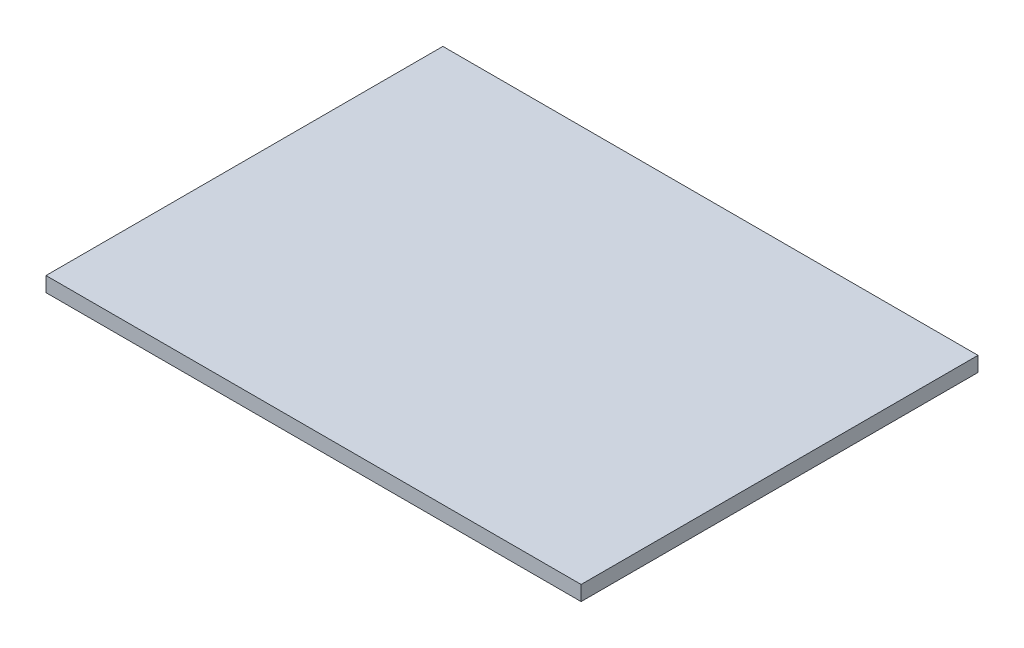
ISO-10303-21;
HEADER;
FILE_DESCRIPTION(('STEP AP214'),'2;1');
FILE_NAME('part.step','',(''),(''),'','','');
FILE_SCHEMA(('AUTOMOTIVE_DESIGN { 1 0 10303 214 1 1 1 1 }'));
ENDSEC;
DATA;
#1=APPLICATION_CONTEXT('core data for automotive mechanical design processes');
#2=APPLICATION_PROTOCOL_DEFINITION('international standard','automotive_design',2000,#1);
#3=PRODUCT_CONTEXT('',#1,'mechanical');
#4=PRODUCT('Part','Part','',(#3));
#5=PRODUCT_RELATED_PRODUCT_CATEGORY('part','',(#4));
#6=PRODUCT_DEFINITION_FORMATION('','',#4);
#7=PRODUCT_DEFINITION_CONTEXT('part definition',#1,'design');
#8=PRODUCT_DEFINITION('design','',#6,#7);
#9=PRODUCT_DEFINITION_SHAPE('','',#8);
#10=(LENGTH_UNIT() NAMED_UNIT(*) SI_UNIT(.MILLI.,.METRE.));
#11=(NAMED_UNIT(*) PLANE_ANGLE_UNIT() SI_UNIT($,.RADIAN.));
#12=(NAMED_UNIT(*) SI_UNIT($,.STERADIAN.) SOLID_ANGLE_UNIT());
#13=UNCERTAINTY_MEASURE_WITH_UNIT(LENGTH_MEASURE(1.E-05),#10,'distance_accuracy_value','');
#14=(GEOMETRIC_REPRESENTATION_CONTEXT(3) GLOBAL_UNCERTAINTY_ASSIGNED_CONTEXT((#13)) GLOBAL_UNIT_ASSIGNED_CONTEXT((#10,
#11,#12)) REPRESENTATION_CONTEXT('',''));
#15=CARTESIAN_POINT('',(0.,0.,0.));
#16=DIRECTION('',(0.,0.,1.));
#17=DIRECTION('',(1.,0.,0.));
#18=AXIS2_PLACEMENT_3D('',#15,#16,#17);
#19=CARTESIAN_POINT('',(180.,5.,-133.5));
#20=DIRECTION('',(-1.,0.,0.));
#21=DIRECTION('',(0.,0.,1.));
#22=AXIS2_PLACEMENT_3D('',#19,#20,#21);
#23=PLANE('',#22);
#24=DIRECTION('',(0.,0.,-1.));
#25=VECTOR('',#24,1.);
#26=CARTESIAN_POINT('',(180.,-5.,-133.5));
#27=LINE('',#26,#25);
#28=CARTESIAN_POINT('',(180.,-5.,133.5));
#29=VERTEX_POINT('',#28);
#30=CARTESIAN_POINT('',(180.,-5.,-133.5));
#31=VERTEX_POINT('',#30);
#32=EDGE_CURVE('E96',#29,#31,#27,.T.);
#33=ORIENTED_EDGE('',*,*,#32,.T.);
#34=DIRECTION('',(0.,-1.,0.));
#35=VECTOR('',#34,1.);
#36=CARTESIAN_POINT('',(180.,5.,-133.5));
#37=LINE('',#36,#35);
#38=CARTESIAN_POINT('',(180.,5.,-133.5));
#39=VERTEX_POINT('',#38);
#40=EDGE_CURVE('E11',#39,#31,#37,.T.);
#41=ORIENTED_EDGE('',*,*,#40,.F.);
#42=DIRECTION('',(0.,0.,-1.));
#43=VECTOR('',#42,1.);
#44=CARTESIAN_POINT('',(180.,5.,-133.5));
#45=LINE('',#44,#43);
#46=CARTESIAN_POINT('',(180.,5.,133.5));
#47=VERTEX_POINT('',#46);
#48=EDGE_CURVE('E84',#47,#39,#45,.T.);
#49=ORIENTED_EDGE('',*,*,#48,.F.);
#50=DIRECTION('',(0.,-1.,0.));
#51=VECTOR('',#50,1.);
#52=CARTESIAN_POINT('',(180.,5.,133.5));
#53=LINE('',#52,#51);
#54=EDGE_CURVE('E92',#47,#29,#53,.T.);
#55=ORIENTED_EDGE('',*,*,#54,.T.);
#56=EDGE_LOOP('',(#33,#41,#49,#55));
#57=FACE_BOUND('',#56,.T.);
#58=ADVANCED_FACE('F33',(#57),#23,.F.);
#59=CARTESIAN_POINT('',(-180.,5.,-133.5));
#60=DIRECTION('',(0.,0.,1.));
#61=DIRECTION('',(1.,0.,0.));
#62=AXIS2_PLACEMENT_3D('',#59,#60,#61);
#63=PLANE('',#62);
#64=DIRECTION('',(-1.,0.,0.));
#65=VECTOR('',#64,1.);
#66=CARTESIAN_POINT('',(-180.,-5.,-133.5));
#67=LINE('',#66,#65);
#68=CARTESIAN_POINT('',(-180.,-5.,-133.5));
#69=VERTEX_POINT('',#68);
#70=EDGE_CURVE('E88',#31,#69,#67,.T.);
#71=ORIENTED_EDGE('',*,*,#70,.T.);
#72=DIRECTION('',(0.,-1.,0.));
#73=VECTOR('',#72,1.);
#74=CARTESIAN_POINT('',(-180.,5.,-133.5));
#75=LINE('',#74,#73);
#76=CARTESIAN_POINT('',(-180.,5.,-133.5));
#77=VERTEX_POINT('',#76);
#78=EDGE_CURVE('E41',#77,#69,#75,.T.);
#79=ORIENTED_EDGE('',*,*,#78,.F.);
#80=DIRECTION('',(-1.,0.,0.));
#81=VECTOR('',#80,1.);
#82=CARTESIAN_POINT('',(-180.,5.,-133.5));
#83=LINE('',#82,#81);
#84=EDGE_CURVE('E79',#39,#77,#83,.T.);
#85=ORIENTED_EDGE('',*,*,#84,.F.);
#86=ORIENTED_EDGE('',*,*,#40,.T.);
#87=EDGE_LOOP('',(#71,#79,#85,#86));
#88=FACE_BOUND('',#87,.T.);
#89=ADVANCED_FACE('F87',(#88),#63,.F.);
#90=CARTESIAN_POINT('',(-180.,5.,-133.5));
#91=DIRECTION('',(1.,0.,0.));
#92=DIRECTION('',(0.,0.,-1.));
#93=AXIS2_PLACEMENT_3D('',#90,#91,#92);
#94=PLANE('',#93);
#95=DIRECTION('',(0.,0.,1.));
#96=VECTOR('',#95,1.);
#97=CARTESIAN_POINT('',(-180.,-5.,-133.5));
#98=LINE('',#97,#96);
#99=CARTESIAN_POINT('',(-180.,-5.,133.5));
#100=VERTEX_POINT('',#99);
#101=EDGE_CURVE('E66',#69,#100,#98,.T.);
#102=ORIENTED_EDGE('',*,*,#101,.T.);
#103=DIRECTION('',(0.,-1.,0.));
#104=VECTOR('',#103,1.);
#105=CARTESIAN_POINT('',(-180.,5.,133.5));
#106=LINE('',#105,#104);
#107=CARTESIAN_POINT('',(-180.,5.,133.5));
#108=VERTEX_POINT('',#107);
#109=EDGE_CURVE('E89',#108,#100,#106,.T.);
#110=ORIENTED_EDGE('',*,*,#109,.F.);
#111=DIRECTION('',(0.,0.,1.));
#112=VECTOR('',#111,1.);
#113=CARTESIAN_POINT('',(-180.,5.,-133.5));
#114=LINE('',#113,#112);
#115=EDGE_CURVE('E82',#77,#108,#114,.T.);
#116=ORIENTED_EDGE('',*,*,#115,.F.);
#117=ORIENTED_EDGE('',*,*,#78,.T.);
#118=EDGE_LOOP('',(#102,#110,#116,#117));
#119=FACE_BOUND('',#118,.T.);
#120=ADVANCED_FACE('F90',(#119),#94,.F.);
#121=CARTESIAN_POINT('',(-180.,5.,133.5));
#122=DIRECTION('',(0.,0.,-1.));
#123=DIRECTION('',(-1.,0.,0.));
#124=AXIS2_PLACEMENT_3D('',#121,#122,#123);
#125=PLANE('',#124);
#126=DIRECTION('',(1.,0.,0.));
#127=VECTOR('',#126,1.);
#128=CARTESIAN_POINT('',(-180.,-5.,133.5));
#129=LINE('',#128,#127);
#130=EDGE_CURVE('E72',#100,#29,#129,.T.);
#131=ORIENTED_EDGE('',*,*,#130,.T.);
#132=ORIENTED_EDGE('',*,*,#54,.F.);
#133=DIRECTION('',(1.,0.,0.));
#134=VECTOR('',#133,1.);
#135=CARTESIAN_POINT('',(-180.,5.,133.5));
#136=LINE('',#135,#134);
#137=EDGE_CURVE('E49',#108,#47,#136,.T.);
#138=ORIENTED_EDGE('',*,*,#137,.F.);
#139=ORIENTED_EDGE('',*,*,#109,.T.);
#140=EDGE_LOOP('',(#131,#132,#138,#139));
#141=FACE_BOUND('',#140,.T.);
#142=ADVANCED_FACE('F103',(#141),#125,.F.);
#143=CARTESIAN_POINT('',(0.,5.,0.));
#144=DIRECTION('',(0.,1.,0.));
#145=DIRECTION('',(0.,0.,1.));
#146=AXIS2_PLACEMENT_3D('',#143,#144,#145);
#147=PLANE('',#146);
#148=ORIENTED_EDGE('',*,*,#48,.T.);
#149=ORIENTED_EDGE('',*,*,#84,.T.);
#150=ORIENTED_EDGE('',*,*,#115,.T.);
#151=ORIENTED_EDGE('',*,*,#137,.T.);
#152=EDGE_LOOP('',(#148,#149,#150,#151));
#153=FACE_BOUND('',#152,.T.);
#154=ADVANCED_FACE('F80',(#153),#147,.T.);
#155=CARTESIAN_POINT('',(0.,-5.,0.));
#156=DIRECTION('',(0.,1.,0.));
#157=DIRECTION('',(0.,0.,1.));
#158=AXIS2_PLACEMENT_3D('',#155,#156,#157);
#159=PLANE('',#158);
#160=ORIENTED_EDGE('',*,*,#32,.F.);
#161=ORIENTED_EDGE('',*,*,#130,.F.);
#162=ORIENTED_EDGE('',*,*,#101,.F.);
#163=ORIENTED_EDGE('',*,*,#70,.F.);
#164=EDGE_LOOP('',(#160,#161,#162,#163));
#165=FACE_BOUND('',#164,.T.);
#166=ADVANCED_FACE('F106',(#165),#159,.F.);
#167=CLOSED_SHELL('',(#58,#89,#120,#142,#154,#166));
#168=MANIFOLD_SOLID_BREP('B2',#167);
#169=ADVANCED_BREP_SHAPE_REPRESENTATION('',(#18,#168),#14);
#170=SHAPE_DEFINITION_REPRESENTATION(#9,#169);
ENDSEC;
END-ISO-10303-21;
